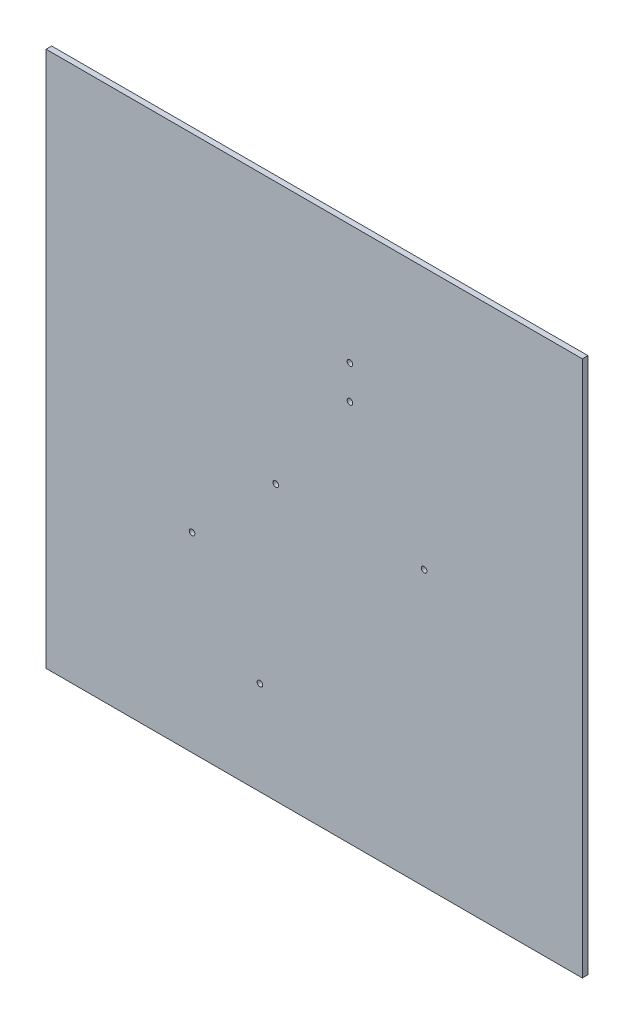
ISO-10303-21;
HEADER;
FILE_DESCRIPTION(('STEP AP214'),'2;1');
FILE_NAME('part.step','',(''),(''),'','','');
FILE_SCHEMA(('AUTOMOTIVE_DESIGN { 1 0 10303 214 1 1 1 1 }'));
ENDSEC;
DATA;
#1=APPLICATION_CONTEXT('core data for automotive mechanical design processes');
#2=APPLICATION_PROTOCOL_DEFINITION('international standard','automotive_design',2000,#1);
#3=PRODUCT_CONTEXT('',#1,'mechanical');
#4=PRODUCT('Part','Part','',(#3));
#5=PRODUCT_RELATED_PRODUCT_CATEGORY('part','',(#4));
#6=PRODUCT_DEFINITION_FORMATION('','',#4);
#7=PRODUCT_DEFINITION_CONTEXT('part definition',#1,'design');
#8=PRODUCT_DEFINITION('design','',#6,#7);
#9=PRODUCT_DEFINITION_SHAPE('','',#8);
#10=(LENGTH_UNIT() NAMED_UNIT(*) SI_UNIT(.MILLI.,.METRE.));
#11=(NAMED_UNIT(*) PLANE_ANGLE_UNIT() SI_UNIT($,.RADIAN.));
#12=(NAMED_UNIT(*) SI_UNIT($,.STERADIAN.) SOLID_ANGLE_UNIT());
#13=UNCERTAINTY_MEASURE_WITH_UNIT(LENGTH_MEASURE(1.E-05),#10,'distance_accuracy_value','');
#14=(GEOMETRIC_REPRESENTATION_CONTEXT(3) GLOBAL_UNCERTAINTY_ASSIGNED_CONTEXT((#13)) GLOBAL_UNIT_ASSIGNED_CONTEXT((#10,
#11,#12)) REPRESENTATION_CONTEXT('',''));
#15=CARTESIAN_POINT('',(0.,0.,0.));
#16=DIRECTION('',(0.,0.,1.));
#17=DIRECTION('',(1.,0.,0.));
#18=AXIS2_PLACEMENT_3D('',#15,#16,#17);
#19=CARTESIAN_POINT('',(0.,0.,3.175));
#20=DIRECTION('',(0.,0.,-1.));
#21=DIRECTION('',(-1.,0.,0.));
#22=AXIS2_PLACEMENT_3D('',#19,#20,#21);
#23=PLANE('',#22);
#24=DIRECTION('',(0.,-1.,0.));
#25=VECTOR('',#24,1.);
#26=CARTESIAN_POINT('',(0.,0.,3.175));
#27=LINE('',#26,#25);
#28=CARTESIAN_POINT('',(0.,304.8,3.175));
#29=VERTEX_POINT('',#28);
#30=CARTESIAN_POINT('',(0.,0.,3.175));
#31=VERTEX_POINT('',#30);
#32=EDGE_CURVE('E85',#29,#31,#27,.T.);
#33=ORIENTED_EDGE('',*,*,#32,.T.);
#34=DIRECTION('',(1.,0.,0.));
#35=VECTOR('',#34,1.);
#36=CARTESIAN_POINT('',(0.,0.,3.175));
#37=LINE('',#36,#35);
#38=CARTESIAN_POINT('',(304.8,0.,3.175));
#39=VERTEX_POINT('',#38);
#40=EDGE_CURVE('E80',#31,#39,#37,.T.);
#41=ORIENTED_EDGE('',*,*,#40,.T.);
#42=DIRECTION('',(0.,1.,0.));
#43=VECTOR('',#42,1.);
#44=CARTESIAN_POINT('',(304.8,0.,3.175));
#45=LINE('',#44,#43);
#46=CARTESIAN_POINT('',(304.8,304.8,3.175));
#47=VERTEX_POINT('',#46);
#48=EDGE_CURVE('E83',#39,#47,#45,.T.);
#49=ORIENTED_EDGE('',*,*,#48,.T.);
#50=DIRECTION('',(-1.,0.,0.));
#51=VECTOR('',#50,1.);
#52=CARTESIAN_POINT('',(0.,304.8,3.175));
#53=LINE('',#52,#51);
#54=EDGE_CURVE('E50',#47,#29,#53,.T.);
#55=ORIENTED_EDGE('',*,*,#54,.T.);
#56=EDGE_LOOP('',(#33,#41,#49,#55));
#57=FACE_BOUND('',#56,.T.);
#58=CARTESIAN_POINT('',(130.547161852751,156.033483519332,3.175));
#59=DIRECTION('',(0.,0.,1.));
#60=DIRECTION('',(1.,0.,0.));
#61=AXIS2_PLACEMENT_3D('',#58,#59,#60);
#62=CIRCLE('',#61,1.58749999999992);
#63=CARTESIAN_POINT('',(132.13466185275,156.033483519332,3.175));
#64=VERTEX_POINT('',#63);
#65=EDGE_CURVE('E100',#64,#64,#62,.T.);
#66=ORIENTED_EDGE('',*,*,#65,.F.);
#67=EDGE_LOOP('',(#66));
#68=FACE_BOUND('',#67,.T.);
#69=CARTESIAN_POINT('',(214.875161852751,156.033483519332,3.175));
#70=DIRECTION('',(0.,0.,1.));
#71=DIRECTION('',(1.,0.,0.));
#72=AXIS2_PLACEMENT_3D('',#69,#70,#71);
#73=CIRCLE('',#72,1.58749999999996);
#74=CARTESIAN_POINT('',(216.462661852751,156.033483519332,3.175));
#75=VERTEX_POINT('',#74);
#76=EDGE_CURVE('E115',#75,#75,#73,.T.);
#77=ORIENTED_EDGE('',*,*,#76,.F.);
#78=EDGE_LOOP('',(#77));
#79=FACE_BOUND('',#78,.T.);
#80=CARTESIAN_POINT('',(82.9518044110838,108.438126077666,3.175));
#81=DIRECTION('',(0.,0.,1.));
#82=DIRECTION('',(1.,0.,0.));
#83=AXIS2_PLACEMENT_3D('',#80,#81,#82);
#84=CIRCLE('',#83,1.58749999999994);
#85=CARTESIAN_POINT('',(84.5393044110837,108.438126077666,3.175));
#86=VERTEX_POINT('',#85);
#87=EDGE_CURVE('E121',#86,#86,#84,.T.);
#88=ORIENTED_EDGE('',*,*,#87,.F.);
#89=EDGE_LOOP('',(#88));
#90=FACE_BOUND('',#89,.T.);
#91=CARTESIAN_POINT('',(121.559234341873,53.3010019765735,3.175));
#92=DIRECTION('',(0.,0.,1.));
#93=DIRECTION('',(1.,0.,0.));
#94=AXIS2_PLACEMENT_3D('',#91,#92,#93);
#95=CIRCLE('',#94,1.58749999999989);
#96=CARTESIAN_POINT('',(123.146734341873,53.3010019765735,3.175));
#97=VERTEX_POINT('',#96);
#98=EDGE_CURVE('E127',#97,#97,#95,.T.);
#99=ORIENTED_EDGE('',*,*,#98,.F.);
#100=EDGE_LOOP('',(#99));
#101=FACE_BOUND('',#100,.T.);
#102=CARTESIAN_POINT('',(172.711161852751,217.64208429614,3.175));
#103=DIRECTION('',(0.,0.,1.));
#104=DIRECTION('',(1.,0.,0.));
#105=AXIS2_PLACEMENT_3D('',#102,#103,#104);
#106=CIRCLE('',#105,1.58749999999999);
#107=CARTESIAN_POINT('',(174.298661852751,217.64208429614,3.175));
#108=VERTEX_POINT('',#107);
#109=EDGE_CURVE('E133',#108,#108,#106,.T.);
#110=ORIENTED_EDGE('',*,*,#109,.F.);
#111=EDGE_LOOP('',(#110));
#112=FACE_BOUND('',#111,.T.);
#113=CARTESIAN_POINT('',(172.711161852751,236.69208429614,3.175));
#114=DIRECTION('',(0.,0.,1.));
#115=DIRECTION('',(1.,0.,0.));
#116=AXIS2_PLACEMENT_3D('',#113,#114,#115);
#117=CIRCLE('',#116,1.58749999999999);
#118=CARTESIAN_POINT('',(174.298661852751,236.69208429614,3.175));
#119=VERTEX_POINT('',#118);
#120=EDGE_CURVE('E139',#119,#119,#117,.T.);
#121=ORIENTED_EDGE('',*,*,#120,.F.);
#122=EDGE_LOOP('',(#121));
#123=FACE_BOUND('',#122,.T.);
#124=ADVANCED_FACE('F33',(#57,#68,#79,#90,#101,#112,#123),#23,.F.);
#125=CARTESIAN_POINT('',(0.,0.,0.));
#126=DIRECTION('',(0.,0.,-1.));
#127=DIRECTION('',(-1.,0.,0.));
#128=AXIS2_PLACEMENT_3D('',#125,#126,#127);
#129=PLANE('',#128);
#130=CARTESIAN_POINT('',(172.711161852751,217.64208429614,0.));
#131=DIRECTION('',(0.,0.,1.));
#132=DIRECTION('',(1.,0.,0.));
#133=AXIS2_PLACEMENT_3D('',#130,#131,#132);
#134=CIRCLE('',#133,1.58749999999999);
#135=CARTESIAN_POINT('',(174.298661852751,217.64208429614,0.));
#136=VERTEX_POINT('',#135);
#137=EDGE_CURVE('E136',#136,#136,#134,.T.);
#138=ORIENTED_EDGE('',*,*,#137,.T.);
#139=EDGE_LOOP('',(#138));
#140=FACE_BOUND('',#139,.T.);
#141=CARTESIAN_POINT('',(82.9518044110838,108.438126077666,0.));
#142=DIRECTION('',(0.,0.,1.));
#143=DIRECTION('',(1.,0.,0.));
#144=AXIS2_PLACEMENT_3D('',#141,#142,#143);
#145=CIRCLE('',#144,1.58749999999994);
#146=CARTESIAN_POINT('',(84.5393044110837,108.438126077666,0.));
#147=VERTEX_POINT('',#146);
#148=EDGE_CURVE('E124',#147,#147,#145,.T.);
#149=ORIENTED_EDGE('',*,*,#148,.T.);
#150=EDGE_LOOP('',(#149));
#151=FACE_BOUND('',#150,.T.);
#152=CARTESIAN_POINT('',(130.547161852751,156.033483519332,0.));
#153=DIRECTION('',(0.,0.,1.));
#154=DIRECTION('',(1.,0.,0.));
#155=AXIS2_PLACEMENT_3D('',#152,#153,#154);
#156=CIRCLE('',#155,1.58749999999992);
#157=CARTESIAN_POINT('',(132.13466185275,156.033483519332,0.));
#158=VERTEX_POINT('',#157);
#159=EDGE_CURVE('E112',#158,#158,#156,.T.);
#160=ORIENTED_EDGE('',*,*,#159,.T.);
#161=EDGE_LOOP('',(#160));
#162=FACE_BOUND('',#161,.T.);
#163=DIRECTION('',(0.,-1.,0.));
#164=VECTOR('',#163,1.);
#165=CARTESIAN_POINT('',(0.,0.,0.));
#166=LINE('',#165,#164);
#167=CARTESIAN_POINT('',(0.,304.8,0.));
#168=VERTEX_POINT('',#167);
#169=CARTESIAN_POINT('',(0.,0.,0.));
#170=VERTEX_POINT('',#169);
#171=EDGE_CURVE('E97',#168,#170,#166,.T.);
#172=ORIENTED_EDGE('',*,*,#171,.F.);
#173=DIRECTION('',(-1.,0.,0.));
#174=VECTOR('',#173,1.);
#175=CARTESIAN_POINT('',(0.,304.8,0.));
#176=LINE('',#175,#174);
#177=CARTESIAN_POINT('',(304.8,304.8,0.));
#178=VERTEX_POINT('',#177);
#179=EDGE_CURVE('E73',#178,#168,#176,.T.);
#180=ORIENTED_EDGE('',*,*,#179,.F.);
#181=DIRECTION('',(0.,1.,0.));
#182=VECTOR('',#181,1.);
#183=CARTESIAN_POINT('',(304.8,0.,0.));
#184=LINE('',#183,#182);
#185=CARTESIAN_POINT('',(304.8,0.,0.));
#186=VERTEX_POINT('',#185);
#187=EDGE_CURVE('E67',#186,#178,#184,.T.);
#188=ORIENTED_EDGE('',*,*,#187,.F.);
#189=DIRECTION('',(1.,0.,0.));
#190=VECTOR('',#189,1.);
#191=CARTESIAN_POINT('',(0.,0.,0.));
#192=LINE('',#191,#190);
#193=EDGE_CURVE('E89',#170,#186,#192,.T.);
#194=ORIENTED_EDGE('',*,*,#193,.F.);
#195=EDGE_LOOP('',(#172,#180,#188,#194));
#196=FACE_BOUND('',#195,.T.);
#197=CARTESIAN_POINT('',(214.875161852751,156.033483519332,0.));
#198=DIRECTION('',(0.,0.,1.));
#199=DIRECTION('',(1.,0.,0.));
#200=AXIS2_PLACEMENT_3D('',#197,#198,#199);
#201=CIRCLE('',#200,1.58749999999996);
#202=CARTESIAN_POINT('',(216.462661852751,156.033483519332,0.));
#203=VERTEX_POINT('',#202);
#204=EDGE_CURVE('E118',#203,#203,#201,.T.);
#205=ORIENTED_EDGE('',*,*,#204,.T.);
#206=EDGE_LOOP('',(#205));
#207=FACE_BOUND('',#206,.T.);
#208=CARTESIAN_POINT('',(121.559234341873,53.3010019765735,0.));
#209=DIRECTION('',(0.,0.,1.));
#210=DIRECTION('',(1.,0.,0.));
#211=AXIS2_PLACEMENT_3D('',#208,#209,#210);
#212=CIRCLE('',#211,1.58749999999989);
#213=CARTESIAN_POINT('',(123.146734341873,53.3010019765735,0.));
#214=VERTEX_POINT('',#213);
#215=EDGE_CURVE('E130',#214,#214,#212,.T.);
#216=ORIENTED_EDGE('',*,*,#215,.T.);
#217=EDGE_LOOP('',(#216));
#218=FACE_BOUND('',#217,.T.);
#219=CARTESIAN_POINT('',(172.711161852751,236.69208429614,0.));
#220=DIRECTION('',(0.,0.,1.));
#221=DIRECTION('',(1.,0.,0.));
#222=AXIS2_PLACEMENT_3D('',#219,#220,#221);
#223=CIRCLE('',#222,1.58749999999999);
#224=CARTESIAN_POINT('',(174.298661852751,236.69208429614,0.));
#225=VERTEX_POINT('',#224);
#226=EDGE_CURVE('E142',#225,#225,#223,.T.);
#227=ORIENTED_EDGE('',*,*,#226,.T.);
#228=EDGE_LOOP('',(#227));
#229=FACE_BOUND('',#228,.T.);
#230=ADVANCED_FACE('F108',(#140,#151,#162,#196,#207,#218,#229),#129,.T.);
#231=CARTESIAN_POINT('',(0.,0.,3.175));
#232=DIRECTION('',(1.,0.,0.));
#233=DIRECTION('',(0.,0.,-1.));
#234=AXIS2_PLACEMENT_3D('',#231,#232,#233);
#235=PLANE('',#234);
#236=ORIENTED_EDGE('',*,*,#171,.T.);
#237=DIRECTION('',(0.,0.,-1.));
#238=VECTOR('',#237,1.);
#239=CARTESIAN_POINT('',(0.,0.,3.175));
#240=LINE('',#239,#238);
#241=EDGE_CURVE('E11',#31,#170,#240,.T.);
#242=ORIENTED_EDGE('',*,*,#241,.F.);
#243=ORIENTED_EDGE('',*,*,#32,.F.);
#244=DIRECTION('',(0.,0.,-1.));
#245=VECTOR('',#244,1.);
#246=CARTESIAN_POINT('',(0.,304.8,3.175));
#247=LINE('',#246,#245);
#248=EDGE_CURVE('E93',#29,#168,#247,.T.);
#249=ORIENTED_EDGE('',*,*,#248,.T.);
#250=EDGE_LOOP('',(#236,#242,#243,#249));
#251=FACE_BOUND('',#250,.T.);
#252=ADVANCED_FACE('F35',(#251),#235,.F.);
#253=CARTESIAN_POINT('',(0.,0.,3.175));
#254=DIRECTION('',(0.,1.,0.));
#255=DIRECTION('',(0.,0.,1.));
#256=AXIS2_PLACEMENT_3D('',#253,#254,#255);
#257=PLANE('',#256);
#258=ORIENTED_EDGE('',*,*,#193,.T.);
#259=DIRECTION('',(0.,0.,-1.));
#260=VECTOR('',#259,1.);
#261=CARTESIAN_POINT('',(304.8,0.,3.175));
#262=LINE('',#261,#260);
#263=EDGE_CURVE('E42',#39,#186,#262,.T.);
#264=ORIENTED_EDGE('',*,*,#263,.F.);
#265=ORIENTED_EDGE('',*,*,#40,.F.);
#266=ORIENTED_EDGE('',*,*,#241,.T.);
#267=EDGE_LOOP('',(#258,#264,#265,#266));
#268=FACE_BOUND('',#267,.T.);
#269=ADVANCED_FACE('F88',(#268),#257,.F.);
#270=CARTESIAN_POINT('',(304.8,0.,3.175));
#271=DIRECTION('',(-1.,0.,0.));
#272=DIRECTION('',(0.,0.,1.));
#273=AXIS2_PLACEMENT_3D('',#270,#271,#272);
#274=PLANE('',#273);
#275=ORIENTED_EDGE('',*,*,#187,.T.);
#276=DIRECTION('',(0.,0.,-1.));
#277=VECTOR('',#276,1.);
#278=CARTESIAN_POINT('',(304.8,304.8,3.175));
#279=LINE('',#278,#277);
#280=EDGE_CURVE('E90',#47,#178,#279,.T.);
#281=ORIENTED_EDGE('',*,*,#280,.F.);
#282=ORIENTED_EDGE('',*,*,#48,.F.);
#283=ORIENTED_EDGE('',*,*,#263,.T.);
#284=EDGE_LOOP('',(#275,#281,#282,#283));
#285=FACE_BOUND('',#284,.T.);
#286=ADVANCED_FACE('F91',(#285),#274,.F.);
#287=CARTESIAN_POINT('',(0.,304.8,3.175));
#288=DIRECTION('',(0.,-1.,0.));
#289=DIRECTION('',(0.,0.,-1.));
#290=AXIS2_PLACEMENT_3D('',#287,#288,#289);
#291=PLANE('',#290);
#292=ORIENTED_EDGE('',*,*,#179,.T.);
#293=ORIENTED_EDGE('',*,*,#248,.F.);
#294=ORIENTED_EDGE('',*,*,#54,.F.);
#295=ORIENTED_EDGE('',*,*,#280,.T.);
#296=EDGE_LOOP('',(#292,#293,#294,#295));
#297=FACE_BOUND('',#296,.T.);
#298=ADVANCED_FACE('F105',(#297),#291,.F.);
#299=CARTESIAN_POINT('',(130.547161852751,156.033483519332,3.175));
#300=DIRECTION('',(0.,0.,-1.));
#301=DIRECTION('',(-1.,0.,0.));
#302=AXIS2_PLACEMENT_3D('',#299,#300,#301);
#303=CYLINDRICAL_SURFACE('',#302,1.58749999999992);
#304=ORIENTED_EDGE('',*,*,#65,.T.);
#305=EDGE_LOOP('',(#304));
#306=FACE_BOUND('',#305,.T.);
#307=ORIENTED_EDGE('',*,*,#159,.F.);
#308=EDGE_LOOP('',(#307));
#309=FACE_BOUND('',#308,.T.);
#310=ADVANCED_FACE('F159',(#306,#309),#303,.F.);
#311=CARTESIAN_POINT('',(214.875161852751,156.033483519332,3.175));
#312=DIRECTION('',(0.,0.,-1.));
#313=DIRECTION('',(-1.,0.,0.));
#314=AXIS2_PLACEMENT_3D('',#311,#312,#313);
#315=CYLINDRICAL_SURFACE('',#314,1.58749999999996);
#316=ORIENTED_EDGE('',*,*,#76,.T.);
#317=EDGE_LOOP('',(#316));
#318=FACE_BOUND('',#317,.T.);
#319=ORIENTED_EDGE('',*,*,#204,.F.);
#320=EDGE_LOOP('',(#319));
#321=FACE_BOUND('',#320,.T.);
#322=ADVANCED_FACE('F205',(#318,#321),#315,.F.);
#323=CARTESIAN_POINT('',(82.9518044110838,108.438126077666,3.175));
#324=DIRECTION('',(0.,0.,-1.));
#325=DIRECTION('',(-1.,0.,0.));
#326=AXIS2_PLACEMENT_3D('',#323,#324,#325);
#327=CYLINDRICAL_SURFACE('',#326,1.58749999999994);
#328=ORIENTED_EDGE('',*,*,#87,.T.);
#329=EDGE_LOOP('',(#328));
#330=FACE_BOUND('',#329,.T.);
#331=ORIENTED_EDGE('',*,*,#148,.F.);
#332=EDGE_LOOP('',(#331));
#333=FACE_BOUND('',#332,.T.);
#334=ADVANCED_FACE('F213',(#330,#333),#327,.F.);
#335=CARTESIAN_POINT('',(121.559234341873,53.3010019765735,3.175));
#336=DIRECTION('',(0.,0.,-1.));
#337=DIRECTION('',(-1.,0.,0.));
#338=AXIS2_PLACEMENT_3D('',#335,#336,#337);
#339=CYLINDRICAL_SURFACE('',#338,1.58749999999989);
#340=ORIENTED_EDGE('',*,*,#98,.T.);
#341=EDGE_LOOP('',(#340));
#342=FACE_BOUND('',#341,.T.);
#343=ORIENTED_EDGE('',*,*,#215,.F.);
#344=EDGE_LOOP('',(#343));
#345=FACE_BOUND('',#344,.T.);
#346=ADVANCED_FACE('F221',(#342,#345),#339,.F.);
#347=CARTESIAN_POINT('',(172.711161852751,217.64208429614,3.175));
#348=DIRECTION('',(0.,0.,-1.));
#349=DIRECTION('',(-1.,0.,0.));
#350=AXIS2_PLACEMENT_3D('',#347,#348,#349);
#351=CYLINDRICAL_SURFACE('',#350,1.58749999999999);
#352=ORIENTED_EDGE('',*,*,#109,.T.);
#353=EDGE_LOOP('',(#352));
#354=FACE_BOUND('',#353,.T.);
#355=ORIENTED_EDGE('',*,*,#137,.F.);
#356=EDGE_LOOP('',(#355));
#357=FACE_BOUND('',#356,.T.);
#358=ADVANCED_FACE('F230',(#354,#357),#351,.F.);
#359=CARTESIAN_POINT('',(172.711161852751,236.69208429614,3.175));
#360=DIRECTION('',(0.,0.,-1.));
#361=DIRECTION('',(-1.,0.,0.));
#362=AXIS2_PLACEMENT_3D('',#359,#360,#361);
#363=CYLINDRICAL_SURFACE('',#362,1.58749999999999);
#364=ORIENTED_EDGE('',*,*,#120,.T.);
#365=EDGE_LOOP('',(#364));
#366=FACE_BOUND('',#365,.T.);
#367=ORIENTED_EDGE('',*,*,#226,.F.);
#368=EDGE_LOOP('',(#367));
#369=FACE_BOUND('',#368,.T.);
#370=ADVANCED_FACE('F148',(#366,#369),#363,.F.);
#371=CLOSED_SHELL('',(#124,#230,#252,#269,#286,#298,#310,#322,#334,#346,#358,#370));
#372=MANIFOLD_SOLID_BREP('B2',#371);
#373=ADVANCED_BREP_SHAPE_REPRESENTATION('',(#18,#372),#14);
#374=SHAPE_DEFINITION_REPRESENTATION(#9,#373);
ENDSEC;
END-ISO-10303-21;
